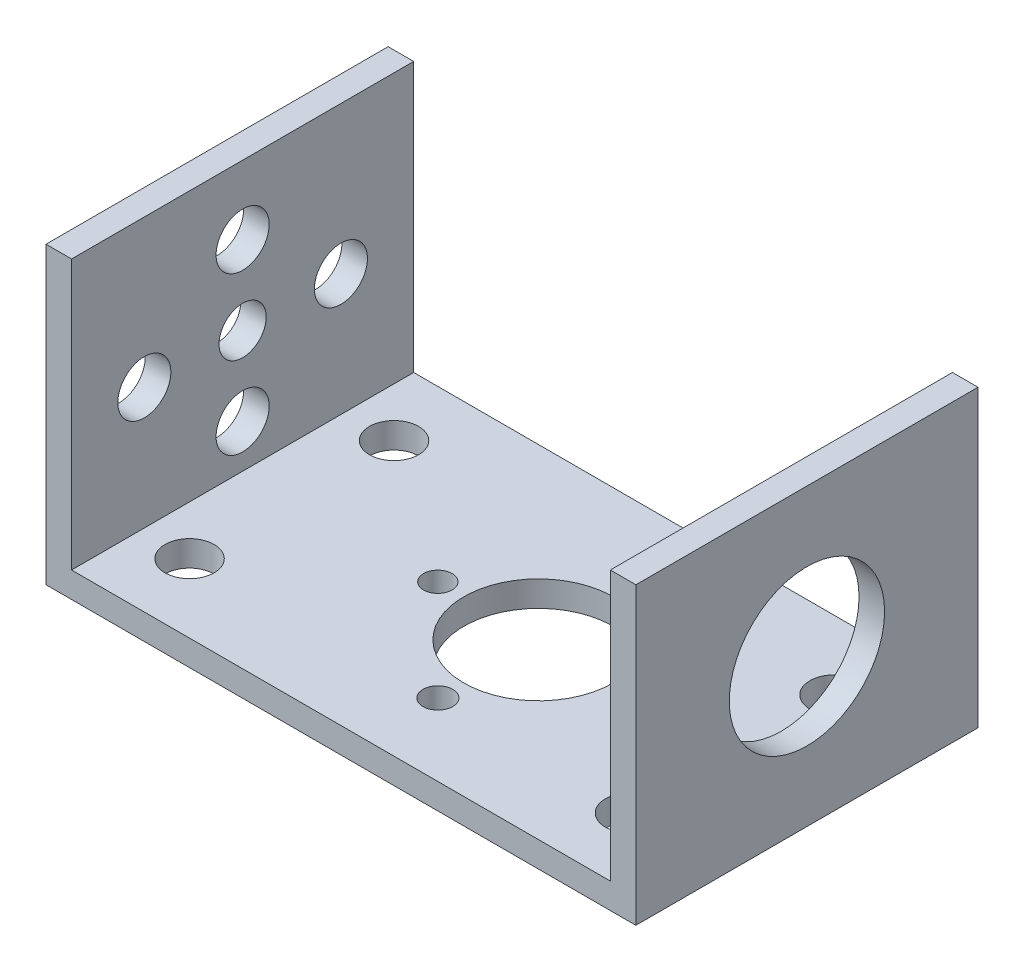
from build123d import *

# Parameters (mm, degrees)
BOSS_EXTRUDE1_DEPTH = 44.196
SKETCH3_R           = 9.65
CUT_EXTRUDE4_DEPTH  = 60.452
SKETCH4_R           = 3.048
CUT_EXTRUDE6_DEPTH  = 8.128
SKETCH5_R           = 10.033
CUT_EXTRUDE7_DEPTH  = 16.002
SKETCH6_R           = 3.429
CUT_EXTRUDE8_DEPTH  = 16.002
SKETCH7_R           = 3.175
CUT_EXTRUDE9_DEPTH  = 16.002
SKETCH8_R           = 1.844605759
SKETCH8_R_2         = 1.926041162
SKETCH8_R_3         = 1.799021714
SKETCH8_R_4         = 1.652452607
CUT_EXTRUDE10_DEPTH = 10


with BuildPart() as part:
    # Sketch1 → Boss-Extrude1 (new body)
    with BuildSketch(Plane.XY):
        Polygon((-37.366024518, 16.636777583), (-37.366024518, -21.463222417), (38.833975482, -21.463222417), (38.833975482, 16.636777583), (35.531975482, 16.636777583), (35.531975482, -18.161222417), (-34.064024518, -18.161222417), (-34.064024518, 16.636777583), align=None)
    extrude(amount=BOSS_EXTRUDE1_DEPTH)

    # Sketch3 → Cut-Extrude4 (cut)
    with BuildSketch(Plane.XZ.offset(21.463222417)):
        with Locations((3.908975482, 21.851071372)):
            Circle(SKETCH3_R)
    extrude(amount=-CUT_EXTRUDE4_DEPTH, mode=Mode.SUBTRACT)

    # Sketch4 → Cut-Extrude6 (cut)
    with BuildSketch(Plane.ZY.offset(37.366024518)):
        with Locations((22.098, -2.413222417)):
            Circle(SKETCH4_R)
    extrude(amount=-CUT_EXTRUDE6_DEPTH, mode=Mode.SUBTRACT)

    # Sketch5 → Cut-Extrude7 (cut)
    with BuildSketch(Plane(origin=(38.833975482, 0, 0), x_dir=(0, 0, -1), z_dir=(1, 0, 0))):
        with Locations((-22.098, -2.413222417)):
            Circle(SKETCH5_R)
    extrude(amount=-CUT_EXTRUDE7_DEPTH, mode=Mode.SUBTRACT)

    # Sketch6 → Cut-Extrude8 (cut)
    with BuildSketch(Plane.ZY.offset(37.366024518)):
        with Locations((22.098, 7.746777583)):
            Circle(SKETCH6_R)
        with Locations((34.798, -2.413222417)):
            Circle(SKETCH6_R)
        with Locations((22.098, -12.573222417)):
            Circle(SKETCH6_R)
        with Locations((9.398, -2.413222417)):
            Circle(SKETCH6_R)
    extrude(amount=-CUT_EXTRUDE8_DEPTH, mode=Mode.SUBTRACT)

    # Sketch7 → Cut-Extrude9 (cut)
    with BuildSketch(Plane(origin=(0, -18.161222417, 0), x_dir=(1, 0, 0), z_dir=(0, 1, 0))):
        with Locations(Location((29.181975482, -8.89, 0), (0, 0, 180))):
            Circle(SKETCH7_R)
        with Locations(Location((29.181975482, -35.306, 0), (0, 0, 180))):
            Circle(SKETCH7_R)
        with Locations(Location((-27.714024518, -8.89, 0), (0, 0, 180))):
            Circle(SKETCH7_R)
        with Locations(Location((-27.714024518, -35.306, 0), (0, 0, 180))):
            Circle(SKETCH7_R)
    extrude(amount=-CUT_EXTRUDE9_DEPTH, mode=Mode.SUBTRACT)

    # Sketch8 → Cut-Extrude10 (cut)
    with BuildSketch(Plane.XZ.offset(21.463222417)):
        with Locations((-9.091024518, 21.851071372)):
            Circle(SKETCH8_R)
        with Locations((3.908975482, 34.851071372)):
            Circle(SKETCH8_R_2)
        with Locations((16.908975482, 21.851071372)):
            Circle(SKETCH8_R_3)
        with Locations((3.908975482, 8.851071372)):
            Circle(SKETCH8_R_4)
    extrude(amount=-CUT_EXTRUDE10_DEPTH, mode=Mode.SUBTRACT)


solid = part.part
